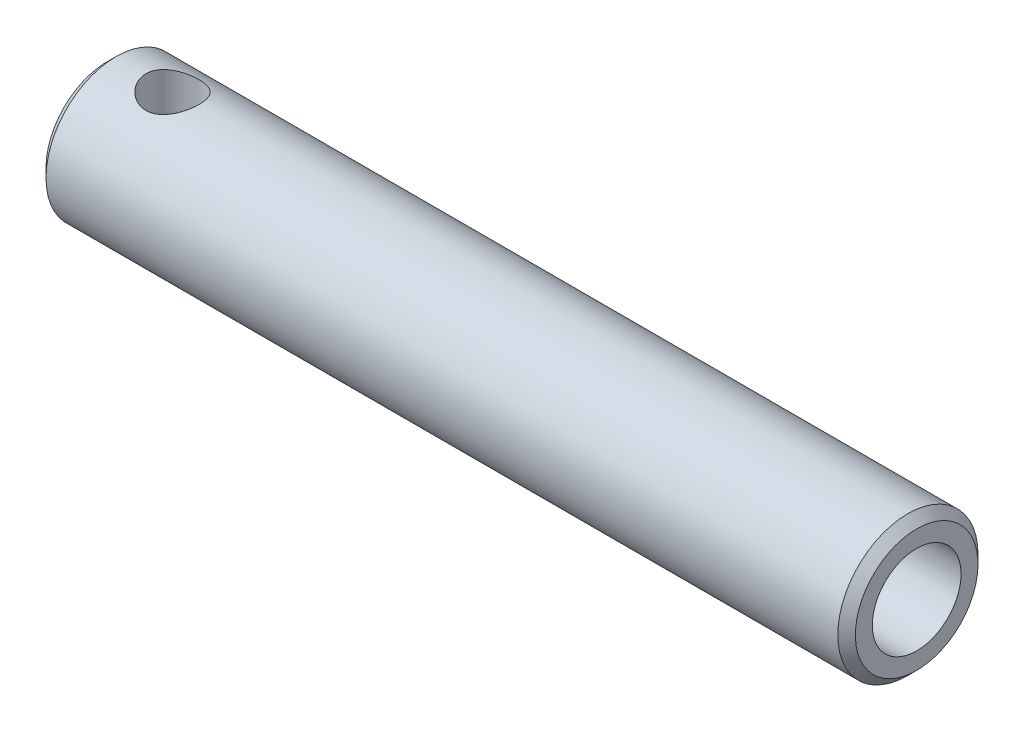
ISO-10303-21;
HEADER;
FILE_DESCRIPTION(('STEP AP214'),'2;1');
FILE_NAME('part.step','',(''),(''),'','','');
FILE_SCHEMA(('AUTOMOTIVE_DESIGN { 1 0 10303 214 1 1 1 1 }'));
ENDSEC;
DATA;
#1=APPLICATION_CONTEXT('core data for automotive mechanical design processes');
#2=APPLICATION_PROTOCOL_DEFINITION('international standard','automotive_design',2000,#1);
#3=PRODUCT_CONTEXT('',#1,'mechanical');
#4=PRODUCT('Part','Part','',(#3));
#5=PRODUCT_RELATED_PRODUCT_CATEGORY('part','',(#4));
#6=PRODUCT_DEFINITION_FORMATION('','',#4);
#7=PRODUCT_DEFINITION_CONTEXT('part definition',#1,'design');
#8=PRODUCT_DEFINITION('design','',#6,#7);
#9=PRODUCT_DEFINITION_SHAPE('','',#8);
#10=(LENGTH_UNIT() NAMED_UNIT(*) SI_UNIT(.MILLI.,.METRE.));
#11=(NAMED_UNIT(*) PLANE_ANGLE_UNIT() SI_UNIT($,.RADIAN.));
#12=(NAMED_UNIT(*) SI_UNIT($,.STERADIAN.) SOLID_ANGLE_UNIT());
#13=UNCERTAINTY_MEASURE_WITH_UNIT(LENGTH_MEASURE(1.E-05),#10,'distance_accuracy_value','');
#14=(GEOMETRIC_REPRESENTATION_CONTEXT(3) GLOBAL_UNCERTAINTY_ASSIGNED_CONTEXT((#13)) GLOBAL_UNIT_ASSIGNED_CONTEXT((#10,
#11,#12)) REPRESENTATION_CONTEXT('',''));
#15=CARTESIAN_POINT('',(0.,0.,0.));
#16=DIRECTION('',(0.,0.,1.));
#17=DIRECTION('',(1.,0.,0.));
#18=AXIS2_PLACEMENT_3D('',#15,#16,#17);
#19=CARTESIAN_POINT('',(82.85,3.10949183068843E-13,0.));
#20=DIRECTION('',(-1.,0.,0.));
#21=DIRECTION('',(0.,1.,0.));
#22=AXIS2_PLACEMENT_3D('',#19,#20,#21);
#23=CONICAL_SURFACE('',#22,7.91,0.785398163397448);
#24=CARTESIAN_POINT('',(83.85,3.14418630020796E-13,0.));
#25=DIRECTION('',(-1.,0.,0.));
#26=DIRECTION('',(0.,1.,0.));
#27=AXIS2_PLACEMENT_3D('',#24,#25,#26);
#28=CIRCLE('',#27,6.91);
#29=CARTESIAN_POINT('',(83.85,6.91000000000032,0.));
#30=VERTEX_POINT('',#29);
#31=EDGE_CURVE('E23',#30,#30,#28,.T.);
#32=ORIENTED_EDGE('',*,*,#31,.T.);
#33=EDGE_LOOP('',(#32));
#34=FACE_BOUND('',#33,.T.);
#35=CARTESIAN_POINT('',(82.86,3.10984652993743E-13,0.));
#36=DIRECTION('',(-1.,0.,0.));
#37=DIRECTION('',(0.,-1.,0.));
#38=AXIS2_PLACEMENT_3D('',#35,#36,#37);
#39=CIRCLE('',#38,7.9);
#40=CARTESIAN_POINT('',(82.86,-7.89999999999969,0.));
#41=VERTEX_POINT('',#40);
#42=EDGE_CURVE('E19',#41,#41,#39,.F.);
#43=ORIENTED_EDGE('',*,*,#42,.T.);
#44=EDGE_LOOP('',(#43));
#45=FACE_BOUND('',#44,.T.);
#46=ADVANCED_FACE('F15',(#34,#45),#23,.T.);
#47=CARTESIAN_POINT('',(83.85,2.99900140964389E-13,0.));
#48=DIRECTION('',(-1.,0.,0.));
#49=DIRECTION('',(0.,-1.,0.));
#50=AXIS2_PLACEMENT_3D('',#47,#48,#49);
#51=PLANE('',#50);
#52=ORIENTED_EDGE('',*,*,#31,.F.);
#53=EDGE_LOOP('',(#52));
#54=FACE_BOUND('',#53,.T.);
#55=CARTESIAN_POINT('',(83.85,3.14418630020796E-13,0.));
#56=DIRECTION('',(-1.,0.,0.));
#57=DIRECTION('',(0.,-1.,0.));
#58=AXIS2_PLACEMENT_3D('',#55,#56,#57);
#59=CIRCLE('',#58,5.);
#60=CARTESIAN_POINT('',(83.85,-4.99999999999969,0.));
#61=VERTEX_POINT('',#60);
#62=EDGE_CURVE('E10',#61,#61,#59,.F.);
#63=ORIENTED_EDGE('',*,*,#62,.F.);
#64=EDGE_LOOP('',(#63));
#65=FACE_BOUND('',#64,.T.);
#66=ADVANCED_FACE('F17',(#54,#65),#51,.F.);
#67=CARTESIAN_POINT('',(83.85,3.14418630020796E-13,0.));
#68=DIRECTION('',(1.,0.,0.));
#69=DIRECTION('',(0.,-1.,0.));
#70=AXIS2_PLACEMENT_3D('',#67,#68,#69);
#71=CYLINDRICAL_SURFACE('',#70,5.);
#72=ORIENTED_EDGE('',*,*,#62,.T.);
#73=EDGE_LOOP('',(#72));
#74=FACE_BOUND('',#73,.T.);
#75=CARTESIAN_POINT('',(51.85,2.02745806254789E-13,0.));
#76=DIRECTION('',(1.,0.,0.));
#77=DIRECTION('',(0.,-1.,0.));
#78=AXIS2_PLACEMENT_3D('',#75,#76,#77);
#79=CIRCLE('',#78,5.);
#80=CARTESIAN_POINT('',(51.85,-4.9999999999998,0.));
#81=VERTEX_POINT('',#80);
#82=EDGE_CURVE('E31',#81,#81,#79,.T.);
#83=ORIENTED_EDGE('',*,*,#82,.F.);
#84=EDGE_LOOP('',(#83));
#85=FACE_BOUND('',#84,.T.);
#86=ADVANCED_FACE('F58',(#74,#85),#71,.F.);
#87=CARTESIAN_POINT('',(51.85,2.02745806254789E-13,0.));
#88=DIRECTION('',(1.,0.,0.));
#89=DIRECTION('',(0.,-1.,0.));
#90=AXIS2_PLACEMENT_3D('',#87,#88,#89);
#91=PLANE('',#90);
#92=ORIENTED_EDGE('',*,*,#82,.T.);
#93=EDGE_LOOP('',(#92));
#94=FACE_BOUND('',#93,.T.);
#95=ADVANCED_FACE('F56',(#94),#91,.T.);
#96=CARTESIAN_POINT('',(-7.35000000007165,0.,0.));
#97=DIRECTION('',(1.,0.,0.));
#98=DIRECTION('',(0.,1.,0.));
#99=AXIS2_PLACEMENT_3D('',#96,#97,#98);
#100=CYLINDRICAL_SURFACE('',#99,7.9);
#101=CARTESIAN_POINT('',(-6.36000000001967,0.,0.));
#102=DIRECTION('',(1.,0.,0.));
#103=DIRECTION('',(0.,1.,0.));
#104=AXIS2_PLACEMENT_3D('',#101,#102,#103);
#105=CIRCLE('',#104,7.9);
#106=CARTESIAN_POINT('',(-6.3600000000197,7.89999999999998,0.));
#107=VERTEX_POINT('',#106);
#108=EDGE_CURVE('E89',#107,#107,#105,.F.);
#109=ORIENTED_EDGE('',*,*,#108,.F.);
#110=EDGE_LOOP('',(#109));
#111=FACE_BOUND('',#110,.T.);
#112=ORIENTED_EDGE('',*,*,#42,.F.);
#113=EDGE_LOOP('',(#112));
#114=FACE_BOUND('',#113,.T.);
#115=CARTESIAN_POINT('',(3.,7.9,0.));
#116=CARTESIAN_POINT('',(3.00000651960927,7.90000492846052,0.162323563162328));
#117=CARTESIAN_POINT('',(2.98678460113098,7.89495384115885,0.324603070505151));
#118=CARTESIAN_POINT('',(2.93446682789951,7.87530990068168,0.644304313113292));
#119=CARTESIAN_POINT('',(2.89537541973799,7.86071868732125,0.801726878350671));
#120=CARTESIAN_POINT('',(2.79290596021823,7.82355831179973,1.10705675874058));
#121=CARTESIAN_POINT('',(2.72957548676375,7.80100478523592,1.2549820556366));
#122=CARTESIAN_POINT('',(2.58067082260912,7.75015966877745,1.53809584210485));
#123=CARTESIAN_POINT('',(2.49509050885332,7.72186649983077,1.67328081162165));
#124=CARTESIAN_POINT('',(2.30023989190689,7.6610845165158,1.93294231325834));
#125=CARTESIAN_POINT('',(2.19017397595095,7.62847488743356,2.05679326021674));
#126=CARTESIAN_POINT('',(1.95116549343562,7.56332199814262,2.2847856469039));
#127=CARTESIAN_POINT('',(1.82221695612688,7.53077876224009,2.38892082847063));
#128=CARTESIAN_POINT('',(1.54293203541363,7.46802796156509,2.57855473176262));
#129=CARTESIAN_POINT('',(1.39195463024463,7.43796229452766,2.6631610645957));
#130=CARTESIAN_POINT('',(1.07659282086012,7.38545588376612,2.80550179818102));
#131=CARTESIAN_POINT('',(0.912213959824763,7.36301200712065,2.86324724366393));
#132=CARTESIAN_POINT('',(0.581923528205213,7.32958460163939,2.94774292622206));
#133=CARTESIAN_POINT('',(0.416364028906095,7.31816074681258,2.97568922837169));
#134=CARTESIAN_POINT('',(0.0825414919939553,7.30678050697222,3.00353256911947));
#135=CARTESIAN_POINT('',(-0.0857203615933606,7.30681922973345,3.00344157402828));
#136=CARTESIAN_POINT('',(-0.40912894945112,7.31798087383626,2.9761259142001));
#137=CARTESIAN_POINT('',(-0.564444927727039,7.32842061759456,2.95057362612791));
#138=CARTESIAN_POINT('',(-0.868392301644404,7.35807053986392,2.87582985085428));
#139=CARTESIAN_POINT('',(-1.01702266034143,7.37728207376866,2.82663471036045));
#140=CARTESIAN_POINT('',(-1.30674189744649,7.42271363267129,2.70510349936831));
#141=CARTESIAN_POINT('',(-1.44763096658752,7.4490612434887,2.63234090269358));
#142=CARTESIAN_POINT('',(-1.71567956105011,7.50575515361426,2.4660379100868));
#143=CARTESIAN_POINT('',(-1.84283423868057,7.53610285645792,2.3724902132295));
#144=CARTESIAN_POINT('',(-2.089042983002,7.59993338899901,2.15966803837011));
#145=CARTESIAN_POINT('',(-2.20693120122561,7.63348799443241,2.03906303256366));
#146=CARTESIAN_POINT('',(-2.4211605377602,7.69815357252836,1.77941400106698));
#147=CARTESIAN_POINT('',(-2.51749817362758,7.72926414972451,1.64036700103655));
#148=CARTESIAN_POINT('',(-2.68722169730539,7.78618320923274,1.34474573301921));
#149=CARTESIAN_POINT('',(-2.76021000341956,7.81189751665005,1.18792377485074));
#150=CARTESIAN_POINT('',(-2.87837893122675,7.85442576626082,0.863006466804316));
#151=CARTESIAN_POINT('',(-2.92357223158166,7.87124376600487,0.694916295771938));
#152=CARTESIAN_POINT('',(-2.98260541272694,7.89336633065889,0.362038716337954));
#153=CARTESIAN_POINT('',(-2.99801463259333,7.8992465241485,0.19756763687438));
#154=CARTESIAN_POINT('',(-3.00162377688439,7.90061616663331,-0.131696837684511));
#155=CARTESIAN_POINT('',(-2.98982991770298,7.89610798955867,-0.296490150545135));
#156=CARTESIAN_POINT('',(-2.94055357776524,7.87758675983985,-0.614878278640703));
#157=CARTESIAN_POINT('',(-2.90410715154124,7.86395727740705,-0.768658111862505));
#158=CARTESIAN_POINT('',(-2.80793284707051,7.82895197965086,-1.06780562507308));
#159=CARTESIAN_POINT('',(-2.7482019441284,7.80757515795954,-1.213172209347));
#160=CARTESIAN_POINT('',(-2.60523798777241,7.75839143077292,-1.49620091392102));
#161=CARTESIAN_POINT('',(-2.52136054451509,7.73041265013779,-1.63350675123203));
#162=CARTESIAN_POINT('',(-2.33321020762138,7.67110861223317,-1.89255944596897));
#163=CARTESIAN_POINT('',(-2.22892965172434,7.63978209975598,-2.01430042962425));
#164=CARTESIAN_POINT('',(-1.99563427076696,7.57491147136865,-2.24635084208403));
#165=CARTESIAN_POINT('',(-1.8655167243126,7.54134633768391,-2.35554865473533));
#166=CARTESIAN_POINT('',(-1.58815537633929,7.47757010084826,-2.55078898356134));
#167=CARTESIAN_POINT('',(-1.44090982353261,7.44735934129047,-2.63682912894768));
#168=CARTESIAN_POINT('',(-1.1320833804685,7.3938095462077,-2.78347589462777));
#169=CARTESIAN_POINT('',(-0.970433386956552,7.37050624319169,-2.84395092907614));
#170=CARTESIAN_POINT('',(-0.638108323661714,7.33416669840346,-2.93641182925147));
#171=CARTESIAN_POINT('',(-0.467439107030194,7.32112388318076,-2.96841593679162));
#172=CARTESIAN_POINT('',(-0.133999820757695,7.30766976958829,-3.00137459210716));
#173=CARTESIAN_POINT('',(0.0285525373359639,7.30648488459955,-3.00423093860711));
#174=CARTESIAN_POINT('',(0.351692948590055,7.31488942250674,-2.98370805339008));
#175=CARTESIAN_POINT('',(0.512281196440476,7.324477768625,-2.96033144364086));
#176=CARTESIAN_POINT('',(0.821692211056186,7.35269714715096,-2.88950106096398));
#177=CARTESIAN_POINT('',(0.970727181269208,7.37102800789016,-2.84284430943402));
#178=CARTESIAN_POINT('',(1.2589360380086,7.41448510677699,-2.72748799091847));
#179=CARTESIAN_POINT('',(1.39810739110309,7.43961308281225,-2.65878278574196));
#180=CARTESIAN_POINT('',(1.67071745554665,7.495501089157,-2.49702772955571));
#181=CARTESIAN_POINT('',(1.80345378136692,7.52649013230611,-2.40287428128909));
#182=CARTESIAN_POINT('',(2.05184926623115,7.58983751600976,-2.19458571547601));
#183=CARTESIAN_POINT('',(2.16750290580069,7.62219629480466,-2.08044416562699));
#184=CARTESIAN_POINT('',(2.38506799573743,7.686816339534,-1.82777523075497));
#185=CARTESIAN_POINT('',(2.48584557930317,7.71897044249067,-1.68823948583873));
#186=CARTESIAN_POINT('',(2.66250073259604,7.77765724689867,-1.39308007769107));
#187=CARTESIAN_POINT('',(2.73837527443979,7.80418926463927,-1.23745446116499));
#188=CARTESIAN_POINT('',(2.86587375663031,7.84980684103,-0.905552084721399));
#189=CARTESIAN_POINT('',(2.91596451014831,7.86841215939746,-0.728613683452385));
#190=CARTESIAN_POINT('',(2.98301506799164,7.89350270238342,-0.367762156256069));
#191=CARTESIAN_POINT('',(2.99999261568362,7.8999944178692,-0.183852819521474));
#192=CARTESIAN_POINT('',(3.,7.9,0.));
#193=B_SPLINE_CURVE_WITH_KNOTS('',3,(#115,#116,#117,#118,#119,#120,#121,#122,#123,#124,#125,
#126,#127,#128,#129,#130,#131,#132,#133,#134,#135,#136,#137,#138,#139,#140,#141,#142,#143,#144,
#145,#146,#147,#148,#149,#150,#151,#152,#153,#154,#155,#156,#157,#158,#159,#160,#161,#162,#163,
#164,#165,#166,#167,#168,#169,#170,#171,#172,#173,#174,#175,#176,#177,#178,#179,#180,#181,#182,
#183,#184,#185,#186,#187,#188,#189,#190,#191,#192),.UNSPECIFIED.,.T.,.F.,(4,2,2,2,2,2,2,2,2,2,2,
2,2,2,2,2,2,2,2,2,2,2,2,2,2,2,2,2,2,2,2,2,2,2,2,2,2,2,4),(0.,0.486292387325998,
0.972501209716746,1.4577605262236,1.94315352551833,2.44753025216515,2.95206681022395,
3.47641548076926,4.00054835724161,4.50274522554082,5.00472775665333,5.4757771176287,
5.94689928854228,6.42707488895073,6.9074194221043,7.42093624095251,7.93453598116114,
8.45646550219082,8.97815676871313,9.47151821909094,9.96476693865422,10.4384776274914,
10.9122498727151,11.4000709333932,11.8880755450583,12.4051248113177,12.9222269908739,
13.4419592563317,13.9613582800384,14.4466330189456,14.9318592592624,15.4015086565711,
15.8712782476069,16.3661200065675,16.8611213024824,17.3838725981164,17.9066874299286,
18.4577729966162,19.0085631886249),.UNSPECIFIED.);
#194=CARTESIAN_POINT('',(3.,7.9,0.));
#195=VERTEX_POINT('',#194);
#196=EDGE_CURVE('E43',#195,#195,#193,.T.);
#197=ORIENTED_EDGE('',*,*,#196,.T.);
#198=EDGE_LOOP('',(#197));
#199=FACE_BOUND('',#198,.T.);
#200=CARTESIAN_POINT('',(3.,-7.9,0.));
#201=CARTESIAN_POINT('',(3.00000651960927,-7.90000492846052,-0.162323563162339));
#202=CARTESIAN_POINT('',(2.98678460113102,-7.89495384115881,-0.324603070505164));
#203=CARTESIAN_POINT('',(2.93446682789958,-7.87530990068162,-0.644304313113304));
#204=CARTESIAN_POINT('',(2.89537541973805,-7.8607186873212,-0.801726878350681));
#205=CARTESIAN_POINT('',(2.79290596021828,-7.82355831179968,-1.10705675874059));
#206=CARTESIAN_POINT('',(2.7295754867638,-7.80100478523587,-1.25498205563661));
#207=CARTESIAN_POINT('',(2.58067082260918,-7.7501596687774,-1.53809584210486));
#208=CARTESIAN_POINT('',(2.49509050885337,-7.72186649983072,-1.67328081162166));
#209=CARTESIAN_POINT('',(2.30023989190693,-7.66108451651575,-1.93294231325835));
#210=CARTESIAN_POINT('',(2.190173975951,-7.62847488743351,-2.05679326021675));
#211=CARTESIAN_POINT('',(1.95116549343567,-7.56332199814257,-2.28478564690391));
#212=CARTESIAN_POINT('',(1.82221695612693,-7.53077876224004,-2.38892082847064));
#213=CARTESIAN_POINT('',(1.54293203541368,-7.46802796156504,-2.57855473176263));
#214=CARTESIAN_POINT('',(1.39195463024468,-7.43796229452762,-2.66316106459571));
#215=CARTESIAN_POINT('',(1.07659282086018,-7.38545588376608,-2.80550179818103));
#216=CARTESIAN_POINT('',(0.912213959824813,-7.36301200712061,-2.86324724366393));
#217=CARTESIAN_POINT('',(0.581923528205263,-7.32958460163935,-2.94774292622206));
#218=CARTESIAN_POINT('',(0.416364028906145,-7.31816074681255,-2.9756892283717));
#219=CARTESIAN_POINT('',(0.0825414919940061,-7.30678050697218,-3.00353256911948));
#220=CARTESIAN_POINT('',(-0.0857203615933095,-7.30681922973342,-3.00344157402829));
#221=CARTESIAN_POINT('',(-0.409128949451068,-7.31798087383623,-2.97612591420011));
#222=CARTESIAN_POINT('',(-0.564444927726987,-7.32842061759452,-2.95057362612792));
#223=CARTESIAN_POINT('',(-0.868392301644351,-7.35807053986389,-2.87582985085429));
#224=CARTESIAN_POINT('',(-1.01702266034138,-7.37728207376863,-2.82663471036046));
#225=CARTESIAN_POINT('',(-1.30674189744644,-7.42271363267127,-2.70510349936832));
#226=CARTESIAN_POINT('',(-1.44763096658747,-7.44906124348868,-2.63234090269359));
#227=CARTESIAN_POINT('',(-1.71567956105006,-7.50575515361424,-2.46603791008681));
#228=CARTESIAN_POINT('',(-1.84283423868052,-7.53610285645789,-2.37249021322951));
#229=CARTESIAN_POINT('',(-2.08904298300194,-7.59993338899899,-2.15966803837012));
#230=CARTESIAN_POINT('',(-2.20693120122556,-7.63348799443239,-2.03906303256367));
#231=CARTESIAN_POINT('',(-2.42116053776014,-7.69815357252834,-1.77941400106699));
#232=CARTESIAN_POINT('',(-2.51749817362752,-7.72926414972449,-1.64036700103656));
#233=CARTESIAN_POINT('',(-2.68722169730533,-7.78618320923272,-1.34474573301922));
#234=CARTESIAN_POINT('',(-2.7602100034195,-7.81189751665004,-1.18792377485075));
#235=CARTESIAN_POINT('',(-2.8783789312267,-7.85442576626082,-0.863006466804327));
#236=CARTESIAN_POINT('',(-2.9235722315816,-7.87124376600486,-0.694916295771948));
#237=CARTESIAN_POINT('',(-2.98260541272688,-7.89336633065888,-0.362038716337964));
#238=CARTESIAN_POINT('',(-2.99801463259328,-7.89924652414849,-0.197567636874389));
#239=CARTESIAN_POINT('',(-3.00162377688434,-7.9006161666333,0.131696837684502));
#240=CARTESIAN_POINT('',(-2.98982991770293,-7.89610798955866,0.296490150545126));
#241=CARTESIAN_POINT('',(-2.94055357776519,-7.87758675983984,0.614878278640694));
#242=CARTESIAN_POINT('',(-2.90410715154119,-7.86395727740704,0.768658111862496));
#243=CARTESIAN_POINT('',(-2.80793284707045,-7.82895197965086,1.06780562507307));
#244=CARTESIAN_POINT('',(-2.74820194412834,-7.80757515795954,1.21317220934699));
#245=CARTESIAN_POINT('',(-2.60523798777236,-7.75839143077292,1.49620091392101));
#246=CARTESIAN_POINT('',(-2.52136054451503,-7.73041265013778,1.63350675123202));
#247=CARTESIAN_POINT('',(-2.33321020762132,-7.67110861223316,1.89255944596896));
#248=CARTESIAN_POINT('',(-2.22892965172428,-7.63978209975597,2.01430042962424));
#249=CARTESIAN_POINT('',(-1.9956342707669,-7.57491147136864,2.24635084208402));
#250=CARTESIAN_POINT('',(-1.86551672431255,-7.5413463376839,2.35554865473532));
#251=CARTESIAN_POINT('',(-1.58815537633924,-7.47757010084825,2.55078898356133));
#252=CARTESIAN_POINT('',(-1.44090982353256,-7.44735934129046,2.63682912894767));
#253=CARTESIAN_POINT('',(-1.13208338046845,-7.39380954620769,2.78347589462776));
#254=CARTESIAN_POINT('',(-0.970433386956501,-7.37050624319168,2.84395092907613));
#255=CARTESIAN_POINT('',(-0.638108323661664,-7.33416669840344,2.93641182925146));
#256=CARTESIAN_POINT('',(-0.467439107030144,-7.32112388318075,2.96841593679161));
#257=CARTESIAN_POINT('',(-0.133999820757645,-7.30766976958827,3.00137459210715));
#258=CARTESIAN_POINT('',(0.0285525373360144,-7.30648488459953,3.0042309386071));
#259=CARTESIAN_POINT('',(0.351692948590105,-7.31488942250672,2.98370805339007));
#260=CARTESIAN_POINT('',(0.512281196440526,-7.32447776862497,2.96033144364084));
#261=CARTESIAN_POINT('',(0.821692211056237,-7.35269714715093,2.88950106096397));
#262=CARTESIAN_POINT('',(0.970727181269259,-7.37102800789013,2.84284430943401));
#263=CARTESIAN_POINT('',(1.25893603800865,-7.41448510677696,2.72748799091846));
#264=CARTESIAN_POINT('',(1.39810739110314,-7.43961308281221,2.65878278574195));
#265=CARTESIAN_POINT('',(1.6707174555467,-7.49550108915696,2.4970277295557));
#266=CARTESIAN_POINT('',(1.80345378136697,-7.52649013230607,2.40287428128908));
#267=CARTESIAN_POINT('',(2.0518492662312,-7.58983751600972,2.194585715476));
#268=CARTESIAN_POINT('',(2.16750290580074,-7.62219629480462,2.08044416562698));
#269=CARTESIAN_POINT('',(2.38506799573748,-7.68681633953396,1.82777523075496));
#270=CARTESIAN_POINT('',(2.48584557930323,-7.71897044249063,1.68823948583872));
#271=CARTESIAN_POINT('',(2.66250073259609,-7.77765724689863,1.39308007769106));
#272=CARTESIAN_POINT('',(2.73837527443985,-7.80418926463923,1.23745446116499));
#273=CARTESIAN_POINT('',(2.86587375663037,-7.84980684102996,0.905552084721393));
#274=CARTESIAN_POINT('',(2.91596451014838,-7.8684121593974,0.728613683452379));
#275=CARTESIAN_POINT('',(2.98301506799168,-7.89350270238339,0.367762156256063));
#276=CARTESIAN_POINT('',(2.99999261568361,-7.8999944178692,0.183852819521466));
#277=CARTESIAN_POINT('',(3.,-7.9,0.));
#278=B_SPLINE_CURVE_WITH_KNOTS('',3,(#200,#201,#202,#203,#204,#205,#206,#207,#208,#209,#210,
#211,#212,#213,#214,#215,#216,#217,#218,#219,#220,#221,#222,#223,#224,#225,#226,#227,#228,#229,
#230,#231,#232,#233,#234,#235,#236,#237,#238,#239,#240,#241,#242,#243,#244,#245,#246,#247,#248,
#249,#250,#251,#252,#253,#254,#255,#256,#257,#258,#259,#260,#261,#262,#263,#264,#265,#266,#267,
#268,#269,#270,#271,#272,#273,#274,#275,#276,#277),.UNSPECIFIED.,.T.,.F.,(4,2,2,2,2,2,2,2,2,2,2,
2,2,2,2,2,2,2,2,2,2,2,2,2,2,2,2,2,2,2,2,2,2,2,2,2,2,2,4),(0.,0.486292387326,0.972501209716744,
1.45776052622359,1.94315352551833,2.44753025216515,2.95206681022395,3.47641548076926,
4.0005483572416,4.50274522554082,5.00472775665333,5.4757771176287,5.94689928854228,
6.42707488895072,6.90741942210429,7.42093624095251,7.93453598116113,8.45646550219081,
8.97815676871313,9.47151821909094,9.96476693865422,10.4384776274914,10.9122498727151,
11.4000709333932,11.8880755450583,12.4051248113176,12.9222269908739,13.4419592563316,
13.9613582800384,14.4466330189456,14.9318592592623,15.4015086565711,15.8712782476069,
16.3661200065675,16.8611213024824,17.3838725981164,17.9066874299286,18.4577729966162,
19.0085631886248),.UNSPECIFIED.);
#279=CARTESIAN_POINT('',(3.,-7.9,0.));
#280=VERTEX_POINT('',#279);
#281=EDGE_CURVE('E35',#280,#280,#278,.T.);
#282=ORIENTED_EDGE('',*,*,#281,.T.);
#283=EDGE_LOOP('',(#282));
#284=FACE_BOUND('',#283,.T.);
#285=ADVANCED_FACE('F52',(#111,#114,#199,#284),#100,.T.);
#286=CARTESIAN_POINT('',(-7.35,0.,0.));
#287=DIRECTION('',(-1.,0.,0.));
#288=DIRECTION('',(0.,1.,0.));
#289=AXIS2_PLACEMENT_3D('',#286,#287,#288);
#290=PLANE('',#289);
#291=CARTESIAN_POINT('',(-7.35000000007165,0.,0.));
#292=DIRECTION('',(1.,0.,0.));
#293=DIRECTION('',(0.,-1.,0.));
#294=AXIS2_PLACEMENT_3D('',#291,#292,#293);
#295=CIRCLE('',#294,6.90999999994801);
#296=CARTESIAN_POINT('',(-7.35000000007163,-6.90999999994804,0.));
#297=VERTEX_POINT('',#296);
#298=EDGE_CURVE('E27',#297,#297,#295,.T.);
#299=ORIENTED_EDGE('',*,*,#298,.F.);
#300=EDGE_LOOP('',(#299));
#301=FACE_BOUND('',#300,.T.);
#302=ADVANCED_FACE('F55',(#301),#290,.T.);
#303=CARTESIAN_POINT('',(-6.35000000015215,0.,0.));
#304=DIRECTION('',(1.,0.,0.));
#305=DIRECTION('',(0.,-1.,0.));
#306=AXIS2_PLACEMENT_3D('',#303,#304,#305);
#307=CONICAL_SURFACE('',#306,7.90999999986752,0.785398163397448);
#308=ORIENTED_EDGE('',*,*,#298,.T.);
#309=EDGE_LOOP('',(#308));
#310=FACE_BOUND('',#309,.T.);
#311=ORIENTED_EDGE('',*,*,#108,.T.);
#312=EDGE_LOOP('',(#311));
#313=FACE_BOUND('',#312,.T.);
#314=ADVANCED_FACE('F76',(#310,#313),#307,.T.);
#315=CARTESIAN_POINT('',(0.,-7.91,0.));
#316=DIRECTION('',(0.,1.,0.));
#317=DIRECTION('',(1.,0.,0.));
#318=AXIS2_PLACEMENT_3D('',#315,#316,#317);
#319=CYLINDRICAL_SURFACE('',#318,3.);
#320=ORIENTED_EDGE('',*,*,#196,.F.);
#321=EDGE_LOOP('',(#320));
#322=FACE_BOUND('',#321,.T.);
#323=ORIENTED_EDGE('',*,*,#281,.F.);
#324=EDGE_LOOP('',(#323));
#325=FACE_BOUND('',#324,.T.);
#326=ADVANCED_FACE('F48',(#322,#325),#319,.F.);
#327=CLOSED_SHELL('',(#46,#66,#86,#95,#285,#302,#314,#326));
#328=MANIFOLD_SOLID_BREP('B1',#327);
#329=ADVANCED_BREP_SHAPE_REPRESENTATION('',(#18,#328),#14);
#330=SHAPE_DEFINITION_REPRESENTATION(#9,#329);
ENDSEC;
END-ISO-10303-21;
